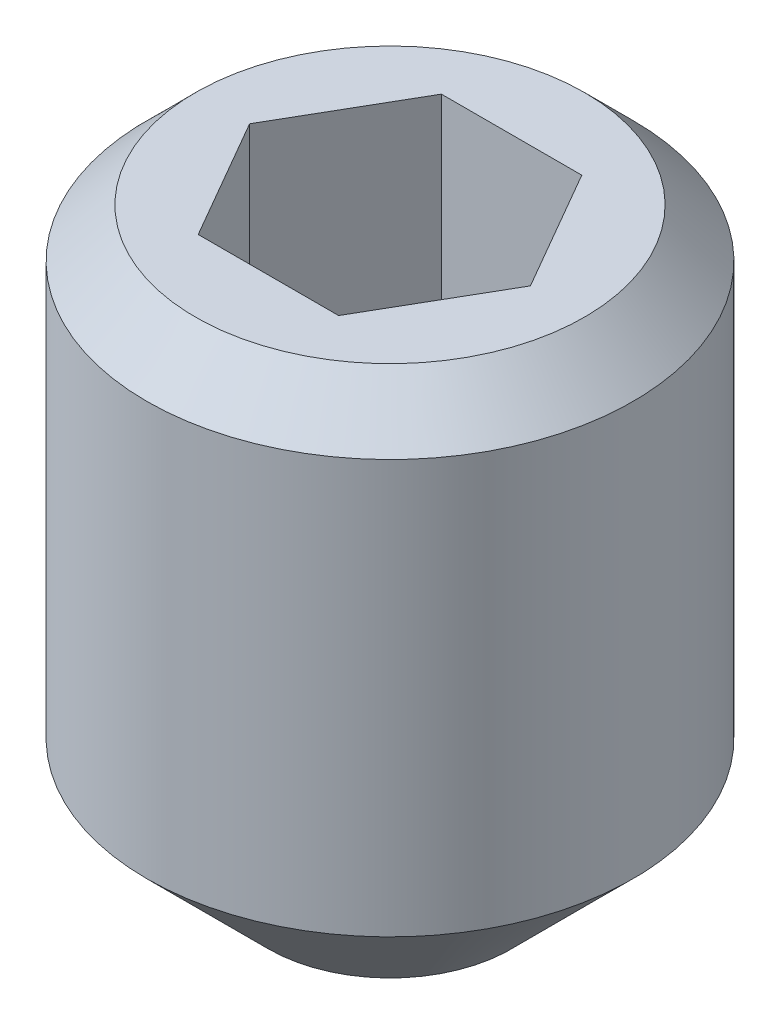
ISO-10303-21;
HEADER;
FILE_DESCRIPTION(('STEP AP214'),'2;1');
FILE_NAME('part.step','',(''),(''),'','','');
FILE_SCHEMA(('AUTOMOTIVE_DESIGN { 1 0 10303 214 1 1 1 1 }'));
ENDSEC;
DATA;
#1=APPLICATION_CONTEXT('core data for automotive mechanical design processes');
#2=APPLICATION_PROTOCOL_DEFINITION('international standard','automotive_design',2000,#1);
#3=PRODUCT_CONTEXT('',#1,'mechanical');
#4=PRODUCT('Part','Part','',(#3));
#5=PRODUCT_RELATED_PRODUCT_CATEGORY('part','',(#4));
#6=PRODUCT_DEFINITION_FORMATION('','',#4);
#7=PRODUCT_DEFINITION_CONTEXT('part definition',#1,'design');
#8=PRODUCT_DEFINITION('design','',#6,#7);
#9=PRODUCT_DEFINITION_SHAPE('','',#8);
#10=(LENGTH_UNIT() NAMED_UNIT(*) SI_UNIT(.MILLI.,.METRE.));
#11=(NAMED_UNIT(*) PLANE_ANGLE_UNIT() SI_UNIT($,.RADIAN.));
#12=(NAMED_UNIT(*) SI_UNIT($,.STERADIAN.) SOLID_ANGLE_UNIT());
#13=UNCERTAINTY_MEASURE_WITH_UNIT(LENGTH_MEASURE(1.E-05),#10,'distance_accuracy_value','');
#14=(GEOMETRIC_REPRESENTATION_CONTEXT(3) GLOBAL_UNCERTAINTY_ASSIGNED_CONTEXT((#13)) GLOBAL_UNIT_ASSIGNED_CONTEXT((#10,
#11,#12)) REPRESENTATION_CONTEXT('',''));
#15=CARTESIAN_POINT('',(0.,0.,0.));
#16=DIRECTION('',(0.,0.,1.));
#17=DIRECTION('',(1.,0.,0.));
#18=AXIS2_PLACEMENT_3D('',#15,#16,#17);
#19=CARTESIAN_POINT('',(0.,-5.27831216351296,0.));
#20=DIRECTION('',(0.,-1.,0.));
#21=DIRECTION('',(0.,0.,-1.));
#22=AXIS2_PLACEMENT_3D('',#19,#20,#21);
#23=CONICAL_SURFACE('',#22,0.,1.04719755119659);
#24=CARTESIAN_POINT('',(0.,-6.,0.));
#25=DIRECTION('',(0.,-1.,0.));
#26=DIRECTION('',(0.,0.,-1.));
#27=AXIS2_PLACEMENT_3D('',#24,#25,#26);
#28=CIRCLE('',#27,1.25);
#29=CARTESIAN_POINT('',(0.,-6.,-1.25));
#30=VERTEX_POINT('',#29);
#31=EDGE_CURVE('E171',#30,#30,#28,.T.);
#32=ORIENTED_EDGE('',*,*,#31,.T.);
#33=EDGE_LOOP('',(#32));
#34=FACE_BOUND('',#33,.T.);
#35=CARTESIAN_POINT('',(0.,-5.27831216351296,0.));
#36=VERTEX_POINT('',#35);
#37=VERTEX_LOOP('',#36);
#38=FACE_BOUND('',#37,.T.);
#39=ADVANCED_FACE('F33',(#34,#38),#23,.F.);
#40=CARTESIAN_POINT('',(0.,-6.,0.));
#41=DIRECTION('',(0.,1.,0.));
#42=DIRECTION('',(0.,0.,1.));
#43=AXIS2_PLACEMENT_3D('',#40,#41,#42);
#44=CONICAL_SURFACE('',#43,1.25,0.785398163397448);
#45=CARTESIAN_POINT('',(0.,-4.74999999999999,0.));
#46=DIRECTION('',(0.,-1.,0.));
#47=DIRECTION('',(0.,0.,-1.));
#48=AXIS2_PLACEMENT_3D('',#45,#46,#47);
#49=CIRCLE('',#48,2.5);
#50=CARTESIAN_POINT('',(0.,-4.74999999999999,-2.5));
#51=VERTEX_POINT('',#50);
#52=EDGE_CURVE('E168',#51,#51,#49,.T.);
#53=ORIENTED_EDGE('',*,*,#52,.T.);
#54=EDGE_LOOP('',(#53));
#55=FACE_BOUND('',#54,.T.);
#56=ORIENTED_EDGE('',*,*,#31,.F.);
#57=EDGE_LOOP('',(#56));
#58=FACE_BOUND('',#57,.T.);
#59=ADVANCED_FACE('F232',(#55,#58),#44,.T.);
#60=CARTESIAN_POINT('',(0.,-6.,0.));
#61=DIRECTION('',(0.,-1.,0.));
#62=DIRECTION('',(0.,0.,-1.));
#63=AXIS2_PLACEMENT_3D('',#60,#61,#62);
#64=CYLINDRICAL_SURFACE('',#63,2.5);
#65=CARTESIAN_POINT('',(0.,-0.500000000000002,0.));
#66=DIRECTION('',(0.,-1.,0.));
#67=DIRECTION('',(0.,0.,-1.));
#68=AXIS2_PLACEMENT_3D('',#65,#66,#67);
#69=CIRCLE('',#68,2.5);
#70=CARTESIAN_POINT('',(0.,-0.500000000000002,-2.5));
#71=VERTEX_POINT('',#70);
#72=EDGE_CURVE('E165',#71,#71,#69,.T.);
#73=ORIENTED_EDGE('',*,*,#72,.T.);
#74=EDGE_LOOP('',(#73));
#75=FACE_BOUND('',#74,.T.);
#76=ORIENTED_EDGE('',*,*,#52,.F.);
#77=EDGE_LOOP('',(#76));
#78=FACE_BOUND('',#77,.T.);
#79=ADVANCED_FACE('F237',(#75,#78),#64,.T.);
#80=CARTESIAN_POINT('',(0.,-0.500000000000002,0.));
#81=DIRECTION('',(0.,-1.,0.));
#82=DIRECTION('',(0.,0.,-1.));
#83=AXIS2_PLACEMENT_3D('',#80,#81,#82);
#84=CONICAL_SURFACE('',#83,2.5,0.785398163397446);
#85=CARTESIAN_POINT('',(0.,0.,0.));
#86=DIRECTION('',(0.,-1.,0.));
#87=DIRECTION('',(0.,0.,-1.));
#88=AXIS2_PLACEMENT_3D('',#85,#86,#87);
#89=CIRCLE('',#88,2.);
#90=CARTESIAN_POINT('',(0.,0.,-2.));
#91=VERTEX_POINT('',#90);
#92=EDGE_CURVE('E151',#91,#91,#89,.T.);
#93=ORIENTED_EDGE('',*,*,#92,.T.);
#94=EDGE_LOOP('',(#93));
#95=FACE_BOUND('',#94,.T.);
#96=ORIENTED_EDGE('',*,*,#72,.F.);
#97=EDGE_LOOP('',(#96));
#98=FACE_BOUND('',#97,.T.);
#99=ADVANCED_FACE('F243',(#95,#98),#84,.T.);
#100=CARTESIAN_POINT('',(1.25,0.,0.));
#101=DIRECTION('',(0.,1.,0.));
#102=DIRECTION('',(0.,0.,1.));
#103=AXIS2_PLACEMENT_3D('',#100,#101,#102);
#104=PLANE('',#103);
#105=DIRECTION('',(-0.5,0.,-0.866025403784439));
#106=VECTOR('',#105,1.);
#107=CARTESIAN_POINT('',(1.39503175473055,0.,-0.0837341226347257));
#108=LINE('',#107,#106);
#109=CARTESIAN_POINT('',(1.44337567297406,0.,0.));
#110=VERTEX_POINT('',#109);
#111=CARTESIAN_POINT('',(0.721687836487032,0.,-1.25));
#112=VERTEX_POINT('',#111);
#113=EDGE_CURVE('E11',#110,#112,#108,.T.);
#114=ORIENTED_EDGE('',*,*,#113,.F.);
#115=DIRECTION('',(0.5,0.,-0.866025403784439));
#116=VECTOR('',#115,1.);
#117=CARTESIAN_POINT('',(1.39503175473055,0.,0.0837341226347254));
#118=LINE('',#117,#116);
#119=CARTESIAN_POINT('',(0.721687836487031,0.,1.25));
#120=VERTEX_POINT('',#119);
#121=EDGE_CURVE('E41',#120,#110,#118,.T.);
#122=ORIENTED_EDGE('',*,*,#121,.F.);
#123=DIRECTION('',(1.,0.,0.));
#124=VECTOR('',#123,1.);
#125=CARTESIAN_POINT('',(1.25,0.,1.25));
#126=LINE('',#125,#124);
#127=CARTESIAN_POINT('',(-0.721687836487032,0.,1.25));
#128=VERTEX_POINT('',#127);
#129=EDGE_CURVE('E180',#128,#120,#126,.T.);
#130=ORIENTED_EDGE('',*,*,#129,.F.);
#131=DIRECTION('',(0.5,0.,0.866025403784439));
#132=VECTOR('',#131,1.);
#133=CARTESIAN_POINT('',(-0.770031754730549,0.,1.16626587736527));
#134=LINE('',#133,#132);
#135=CARTESIAN_POINT('',(-1.44337567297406,0.,0.));
#136=VERTEX_POINT('',#135);
#137=EDGE_CURVE('E177',#136,#128,#134,.T.);
#138=ORIENTED_EDGE('',*,*,#137,.F.);
#139=DIRECTION('',(-0.5,0.,0.866025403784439));
#140=VECTOR('',#139,1.);
#141=CARTESIAN_POINT('',(-0.770031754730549,0.,-1.16626587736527));
#142=LINE('',#141,#140);
#143=CARTESIAN_POINT('',(-0.721687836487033,0.,-1.25));
#144=VERTEX_POINT('',#143);
#145=EDGE_CURVE('E124',#144,#136,#142,.T.);
#146=ORIENTED_EDGE('',*,*,#145,.F.);
#147=DIRECTION('',(-1.,0.,0.));
#148=VECTOR('',#147,1.);
#149=CARTESIAN_POINT('',(1.25,0.,-1.25));
#150=LINE('',#149,#148);
#151=EDGE_CURVE('E183',#112,#144,#150,.T.);
#152=ORIENTED_EDGE('',*,*,#151,.F.);
#153=EDGE_LOOP('',(#114,#122,#130,#138,#146,#152));
#154=FACE_BOUND('',#153,.T.);
#155=ORIENTED_EDGE('',*,*,#92,.F.);
#156=EDGE_LOOP('',(#155));
#157=FACE_BOUND('',#156,.T.);
#158=ADVANCED_FACE('F247',(#154,#157),#104,.T.);
#159=CARTESIAN_POINT('',(-2.1650635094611,-2.5,1.25));
#160=DIRECTION('',(0.,1.,0.));
#161=DIRECTION('',(0.,0.,1.));
#162=AXIS2_PLACEMENT_3D('',#159,#160,#161);
#163=PLANE('',#162);
#164=DIRECTION('',(1.,0.,0.));
#165=VECTOR('',#164,1.);
#166=CARTESIAN_POINT('',(-0.721687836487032,-2.5,1.25));
#167=LINE('',#166,#165);
#168=CARTESIAN_POINT('',(0.,-2.5,1.25));
#169=VERTEX_POINT('',#168);
#170=CARTESIAN_POINT('',(0.721687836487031,-2.5,1.25));
#171=VERTEX_POINT('',#170);
#172=EDGE_CURVE('E134',#169,#171,#167,.T.);
#173=ORIENTED_EDGE('',*,*,#172,.T.);
#174=DIRECTION('',(0.5,0.,-0.866025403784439));
#175=VECTOR('',#174,1.);
#176=CARTESIAN_POINT('',(0.721687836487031,-2.5,1.25));
#177=LINE('',#176,#175);
#178=CARTESIAN_POINT('',(1.08253175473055,-2.5,0.624999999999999));
#179=VERTEX_POINT('',#178);
#180=EDGE_CURVE('E139',#171,#179,#177,.T.);
#181=ORIENTED_EDGE('',*,*,#180,.T.);
#182=CARTESIAN_POINT('',(0.,-2.5,0.));
#183=DIRECTION('',(0.,-1.,0.));
#184=DIRECTION('',(0.,0.,-1.));
#185=AXIS2_PLACEMENT_3D('',#182,#183,#184);
#186=CIRCLE('',#185,1.25);
#187=EDGE_CURVE('E202',#179,#169,#186,.T.);
#188=ORIENTED_EDGE('',*,*,#187,.T.);
#189=EDGE_LOOP('',(#173,#181,#188));
#190=FACE_BOUND('',#189,.T.);
#191=ADVANCED_FACE('F214',(#190),#163,.T.);
#192=CARTESIAN_POINT('',(1.44337567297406,-2.5,0.));
#193=VERTEX_POINT('',#192);
#194=EDGE_CURVE('E138',#179,#193,#177,.T.);
#195=ORIENTED_EDGE('',*,*,#194,.T.);
#196=DIRECTION('',(-0.5,0.,-0.866025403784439));
#197=VECTOR('',#196,1.);
#198=CARTESIAN_POINT('',(1.44337567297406,-2.5,0.));
#199=LINE('',#198,#197);
#200=CARTESIAN_POINT('',(1.08253175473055,-2.5,-0.625));
#201=VERTEX_POINT('',#200);
#202=EDGE_CURVE('E143',#193,#201,#199,.T.);
#203=ORIENTED_EDGE('',*,*,#202,.T.);
#204=EDGE_CURVE('E178',#201,#179,#186,.T.);
#205=ORIENTED_EDGE('',*,*,#204,.T.);
#206=EDGE_LOOP('',(#195,#203,#205));
#207=FACE_BOUND('',#206,.T.);
#208=ADVANCED_FACE('F208',(#207),#163,.T.);
#209=CARTESIAN_POINT('',(0.721687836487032,-2.5,-1.25));
#210=VERTEX_POINT('',#209);
#211=EDGE_CURVE('E142',#201,#210,#199,.T.);
#212=ORIENTED_EDGE('',*,*,#211,.T.);
#213=DIRECTION('',(-1.,0.,0.));
#214=VECTOR('',#213,1.);
#215=CARTESIAN_POINT('',(0.721687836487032,-2.5,-1.25));
#216=LINE('',#215,#214);
#217=CARTESIAN_POINT('',(0.,-2.5,-1.25));
#218=VERTEX_POINT('',#217);
#219=EDGE_CURVE('E128',#210,#218,#216,.T.);
#220=ORIENTED_EDGE('',*,*,#219,.T.);
#221=EDGE_CURVE('E175',#218,#201,#186,.T.);
#222=ORIENTED_EDGE('',*,*,#221,.T.);
#223=EDGE_LOOP('',(#212,#220,#222));
#224=FACE_BOUND('',#223,.T.);
#225=ADVANCED_FACE('F222',(#224),#163,.T.);
#226=CARTESIAN_POINT('',(-0.721687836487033,-2.5,-1.25));
#227=VERTEX_POINT('',#226);
#228=EDGE_CURVE('E146',#218,#227,#216,.T.);
#229=ORIENTED_EDGE('',*,*,#228,.T.);
#230=DIRECTION('',(-0.5,0.,0.866025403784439));
#231=VECTOR('',#230,1.);
#232=CARTESIAN_POINT('',(-0.721687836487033,-2.5,-1.25));
#233=LINE('',#232,#231);
#234=CARTESIAN_POINT('',(-1.08253175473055,-2.5,-0.625));
#235=VERTEX_POINT('',#234);
#236=EDGE_CURVE('E117',#227,#235,#233,.T.);
#237=ORIENTED_EDGE('',*,*,#236,.T.);
#238=EDGE_CURVE('E174',#235,#218,#186,.T.);
#239=ORIENTED_EDGE('',*,*,#238,.T.);
#240=EDGE_LOOP('',(#229,#237,#239));
#241=FACE_BOUND('',#240,.T.);
#242=ADVANCED_FACE('F196',(#241),#163,.T.);
#243=CARTESIAN_POINT('',(-1.44337567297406,-2.5,0.));
#244=VERTEX_POINT('',#243);
#245=EDGE_CURVE('E107',#235,#244,#233,.T.);
#246=ORIENTED_EDGE('',*,*,#245,.T.);
#247=DIRECTION('',(0.5,0.,0.866025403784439));
#248=VECTOR('',#247,1.);
#249=CARTESIAN_POINT('',(-1.44337567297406,-2.5,0.));
#250=LINE('',#249,#248);
#251=CARTESIAN_POINT('',(-1.08253175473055,-2.5,0.625));
#252=VERTEX_POINT('',#251);
#253=EDGE_CURVE('E111',#244,#252,#250,.T.);
#254=ORIENTED_EDGE('',*,*,#253,.T.);
#255=EDGE_CURVE('E113',#252,#235,#186,.T.);
#256=ORIENTED_EDGE('',*,*,#255,.T.);
#257=EDGE_LOOP('',(#246,#254,#256));
#258=FACE_BOUND('',#257,.T.);
#259=ADVANCED_FACE('F109',(#258),#163,.T.);
#260=CARTESIAN_POINT('',(-0.721687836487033,-2.5,-1.25));
#261=DIRECTION('',(-0.866025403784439,0.,-0.5));
#262=DIRECTION('',(-0.5,0.,0.866025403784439));
#263=AXIS2_PLACEMENT_3D('',#260,#261,#262);
#264=PLANE('',#263);
#265=ORIENTED_EDGE('',*,*,#145,.T.);
#266=DIRECTION('',(0.,1.,0.));
#267=VECTOR('',#266,1.);
#268=CARTESIAN_POINT('',(-1.44337567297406,-2.5,0.));
#269=LINE('',#268,#267);
#270=EDGE_CURVE('E121',#244,#136,#269,.T.);
#271=ORIENTED_EDGE('',*,*,#270,.F.);
#272=ORIENTED_EDGE('',*,*,#245,.F.);
#273=ORIENTED_EDGE('',*,*,#236,.F.);
#274=DIRECTION('',(0.,1.,0.));
#275=VECTOR('',#274,1.);
#276=CARTESIAN_POINT('',(-0.721687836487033,-2.5,-1.25));
#277=LINE('',#276,#275);
#278=EDGE_CURVE('E149',#227,#144,#277,.T.);
#279=ORIENTED_EDGE('',*,*,#278,.T.);
#280=EDGE_LOOP('',(#265,#271,#272,#273,#279));
#281=FACE_BOUND('',#280,.T.);
#282=ADVANCED_FACE('F122',(#281),#264,.F.);
#283=CARTESIAN_POINT('',(0.721687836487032,-2.5,-1.25));
#284=DIRECTION('',(0.,0.,-1.));
#285=DIRECTION('',(-1.,0.,0.));
#286=AXIS2_PLACEMENT_3D('',#283,#284,#285);
#287=PLANE('',#286);
#288=ORIENTED_EDGE('',*,*,#151,.T.);
#289=ORIENTED_EDGE('',*,*,#278,.F.);
#290=ORIENTED_EDGE('',*,*,#228,.F.);
#291=ORIENTED_EDGE('',*,*,#219,.F.);
#292=DIRECTION('',(0.,1.,0.));
#293=VECTOR('',#292,1.);
#294=CARTESIAN_POINT('',(0.721687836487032,-2.5,-1.25));
#295=LINE('',#294,#293);
#296=EDGE_CURVE('E152',#210,#112,#295,.T.);
#297=ORIENTED_EDGE('',*,*,#296,.T.);
#298=EDGE_LOOP('',(#288,#289,#290,#291,#297));
#299=FACE_BOUND('',#298,.T.);
#300=ADVANCED_FACE('F189',(#299),#287,.F.);
#301=CARTESIAN_POINT('',(1.44337567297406,-2.5,0.));
#302=DIRECTION('',(0.866025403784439,0.,-0.5));
#303=DIRECTION('',(-0.5,0.,-0.866025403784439));
#304=AXIS2_PLACEMENT_3D('',#301,#302,#303);
#305=PLANE('',#304);
#306=ORIENTED_EDGE('',*,*,#113,.T.);
#307=ORIENTED_EDGE('',*,*,#296,.F.);
#308=ORIENTED_EDGE('',*,*,#211,.F.);
#309=ORIENTED_EDGE('',*,*,#202,.F.);
#310=DIRECTION('',(0.,1.,0.));
#311=VECTOR('',#310,1.);
#312=CARTESIAN_POINT('',(1.44337567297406,-2.5,0.));
#313=LINE('',#312,#311);
#314=EDGE_CURVE('E155',#193,#110,#313,.T.);
#315=ORIENTED_EDGE('',*,*,#314,.T.);
#316=EDGE_LOOP('',(#306,#307,#308,#309,#315));
#317=FACE_BOUND('',#316,.T.);
#318=ADVANCED_FACE('F219',(#317),#305,.F.);
#319=CARTESIAN_POINT('',(0.721687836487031,-2.5,1.25));
#320=DIRECTION('',(0.866025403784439,0.,0.5));
#321=DIRECTION('',(0.5,0.,-0.866025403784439));
#322=AXIS2_PLACEMENT_3D('',#319,#320,#321);
#323=PLANE('',#322);
#324=ORIENTED_EDGE('',*,*,#121,.T.);
#325=ORIENTED_EDGE('',*,*,#314,.F.);
#326=ORIENTED_EDGE('',*,*,#194,.F.);
#327=ORIENTED_EDGE('',*,*,#180,.F.);
#328=DIRECTION('',(0.,1.,0.));
#329=VECTOR('',#328,1.);
#330=CARTESIAN_POINT('',(0.721687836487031,-2.5,1.25));
#331=LINE('',#330,#329);
#332=EDGE_CURVE('E158',#171,#120,#331,.T.);
#333=ORIENTED_EDGE('',*,*,#332,.T.);
#334=EDGE_LOOP('',(#324,#325,#326,#327,#333));
#335=FACE_BOUND('',#334,.T.);
#336=ADVANCED_FACE('F213',(#335),#323,.F.);
#337=CARTESIAN_POINT('',(-0.721687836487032,-2.5,1.25));
#338=DIRECTION('',(0.,0.,1.));
#339=DIRECTION('',(1.,0.,0.));
#340=AXIS2_PLACEMENT_3D('',#337,#338,#339);
#341=PLANE('',#340);
#342=ORIENTED_EDGE('',*,*,#129,.T.);
#343=ORIENTED_EDGE('',*,*,#332,.F.);
#344=ORIENTED_EDGE('',*,*,#172,.F.);
#345=CARTESIAN_POINT('',(-0.721687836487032,-2.5,1.25));
#346=VERTEX_POINT('',#345);
#347=EDGE_CURVE('E48',#346,#169,#167,.T.);
#348=ORIENTED_EDGE('',*,*,#347,.F.);
#349=DIRECTION('',(0.,1.,0.));
#350=VECTOR('',#349,1.);
#351=CARTESIAN_POINT('',(-0.721687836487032,-2.5,1.25));
#352=LINE('',#351,#350);
#353=EDGE_CURVE('E127',#346,#128,#352,.T.);
#354=ORIENTED_EDGE('',*,*,#353,.T.);
#355=EDGE_LOOP('',(#342,#343,#344,#348,#354));
#356=FACE_BOUND('',#355,.T.);
#357=ADVANCED_FACE('F217',(#356),#341,.F.);
#358=CARTESIAN_POINT('',(-1.44337567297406,-2.5,0.));
#359=DIRECTION('',(-0.866025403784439,0.,0.5));
#360=DIRECTION('',(0.5,0.,0.866025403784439));
#361=AXIS2_PLACEMENT_3D('',#358,#359,#360);
#362=PLANE('',#361);
#363=ORIENTED_EDGE('',*,*,#137,.T.);
#364=ORIENTED_EDGE('',*,*,#353,.F.);
#365=EDGE_CURVE('E133',#252,#346,#250,.T.);
#366=ORIENTED_EDGE('',*,*,#365,.F.);
#367=ORIENTED_EDGE('',*,*,#253,.F.);
#368=ORIENTED_EDGE('',*,*,#270,.T.);
#369=EDGE_LOOP('',(#363,#364,#366,#367,#368));
#370=FACE_BOUND('',#369,.T.);
#371=ADVANCED_FACE('F131',(#370),#362,.F.);
#372=ORIENTED_EDGE('',*,*,#365,.T.);
#373=ORIENTED_EDGE('',*,*,#347,.T.);
#374=EDGE_CURVE('E201',#169,#252,#186,.T.);
#375=ORIENTED_EDGE('',*,*,#374,.T.);
#376=EDGE_LOOP('',(#372,#373,#375));
#377=FACE_BOUND('',#376,.T.);
#378=ADVANCED_FACE('F229',(#377),#163,.T.);
#379=CARTESIAN_POINT('',(0.,-2.5,0.));
#380=DIRECTION('',(0.,1.,0.));
#381=DIRECTION('',(0.,0.,1.));
#382=AXIS2_PLACEMENT_3D('',#379,#380,#381);
#383=CONICAL_SURFACE('',#382,1.25,1.0471975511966);
#384=CARTESIAN_POINT('',(0.,-3.22168783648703,0.));
#385=VERTEX_POINT('',#384);
#386=VERTEX_LOOP('',#385);
#387=FACE_BOUND('',#386,.T.);
#388=ORIENTED_EDGE('',*,*,#221,.F.);
#389=ORIENTED_EDGE('',*,*,#238,.F.);
#390=ORIENTED_EDGE('',*,*,#255,.F.);
#391=ORIENTED_EDGE('',*,*,#374,.F.);
#392=ORIENTED_EDGE('',*,*,#187,.F.);
#393=ORIENTED_EDGE('',*,*,#204,.F.);
#394=EDGE_LOOP('',(#388,#389,#390,#391,#392,#393));
#395=FACE_BOUND('',#394,.T.);
#396=ADVANCED_FACE('F35',(#387,#395),#383,.F.);
#397=CLOSED_SHELL('',(#39,#59,#79,#99,#158,#191,#208,#225,#242,#259,#282,#300,#318,#336,#357,
#371,#378,#396));
#398=MANIFOLD_SOLID_BREP('B2',#397);
#399=ADVANCED_BREP_SHAPE_REPRESENTATION('',(#18,#398),#14);
#400=SHAPE_DEFINITION_REPRESENTATION(#9,#399);
ENDSEC;
END-ISO-10303-21;
